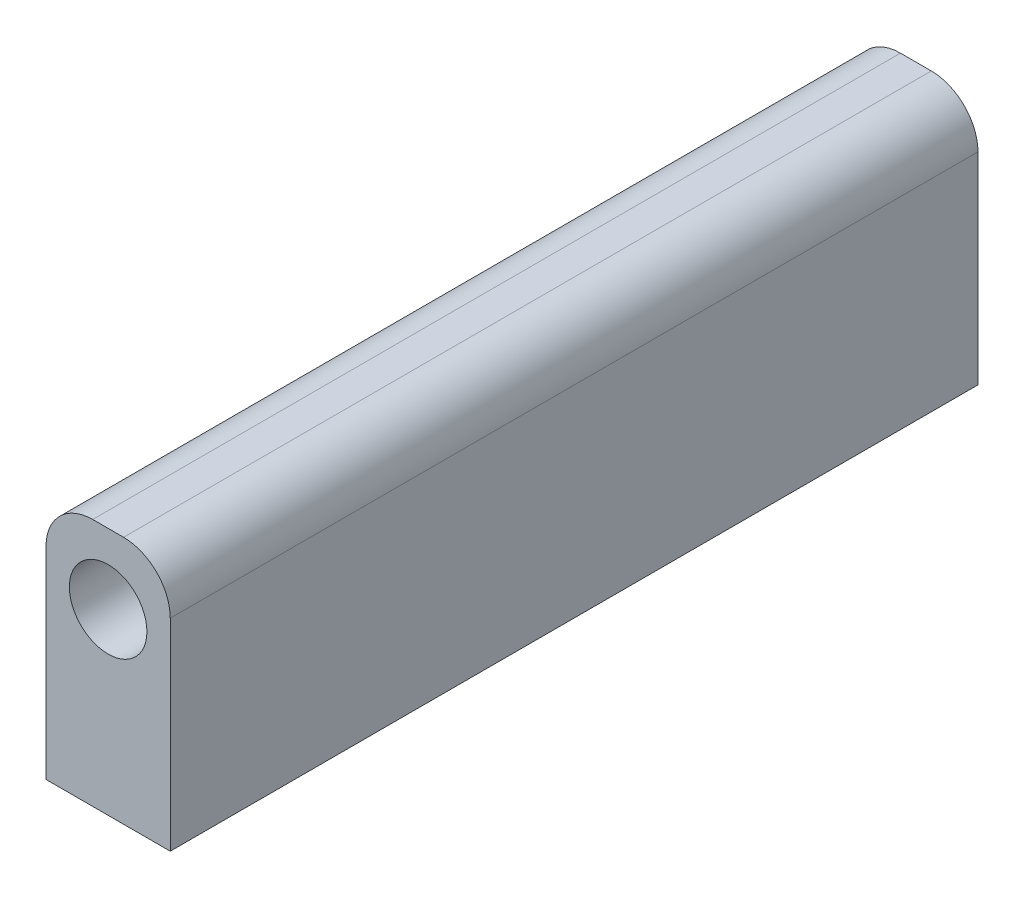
from build123d import *

# Parameters (mm, degrees)
SKETCH1_R           = 3.9624
BOSS_EXTRUDE1_DEPTH = 41.275
SKETCH2_R           = 3.9624
CUT_EXTRUDE1_DEPTH  = 15.875
FILLET1_R           = 4.7752


with BuildPart() as part:
    # Sketch1 → Boss-Extrude1 (new, symmetric)
    with BuildSketch(Plane.XY):
        Polygon((0, 0), (6.35, 0), (6.35, 25.4), (-6.35, 25.4), (-6.35, 0), align=None)
        with Locations((0, 18.2372)):
            Circle(SKETCH1_R, mode=Mode.SUBTRACT)
    extrude(amount=BOSS_EXTRUDE1_DEPTH, both=True)

    # Sketch2 → Cut-Extrude1 (cut)
    with BuildSketch(Plane(origin=(0, 0, 0), x_dir=(1, 0, 0), z_dir=(0, 1, 0))):
        with Locations(Location((0, -31.75, 0), (0, 0, 143.405069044))):
            Circle(SKETCH2_R)
        with Locations(Location((0, 31.75, 0), (0, 0, 143.405069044))):
            Circle(SKETCH2_R)
    extrude(amount=CUT_EXTRUDE1_DEPTH, mode=Mode.SUBTRACT)

    # Fillet1
    fillet1_edges = [part.edges().sort_by_distance(p)[0] for p in [
        (-6.35, 25.4, 0),
        (6.35, 25.4, 0),
    ]]
    fillet(fillet1_edges, radius=FILLET1_R)


solid = part.part
